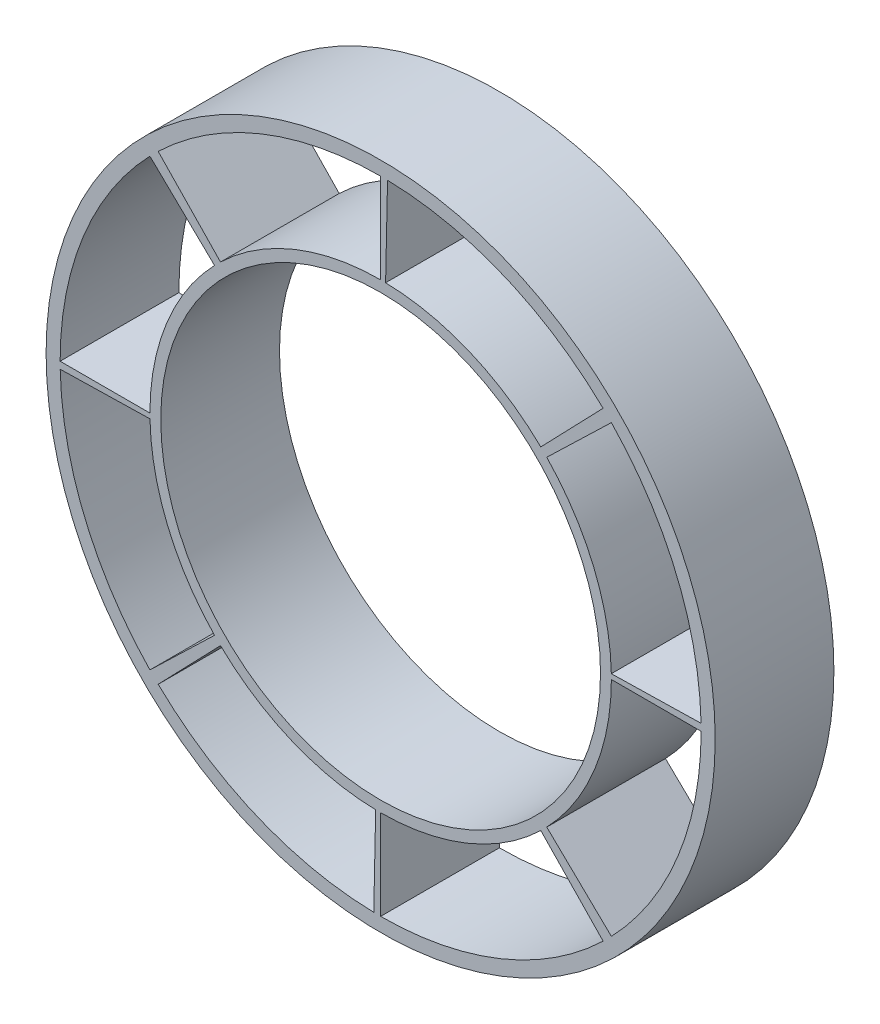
from build123d import *

# Parameters (mm, degrees)
ESQUISSE1_R        = 28.181352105
ESQUISSE1_R_2      = 18.520961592
BOSS_EXTRU_1_DEPTH = 10


with BuildPart() as part:
    # Esquisse1 → Boss.-Extru.1 (new body)
    with BuildSketch(Plane.XY):
        Circle(ESQUISSE1_R)
        with BuildLine():
            ThreePointArc((-13.490160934, -13.991873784), (-7.46697621, -17.944393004), (-0.417881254, -19.431478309))
            Line((-0.417881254, -19.431478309), (-0.580474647, -26.992071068))
            ThreePointArc((-0.580474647, -26.992071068), (-10.372301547, -24.926375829), (-18.739046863, -19.435971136))
            Line((-18.739046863, -19.435971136), (-13.490160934, -13.991873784))
        make_face(mode=Mode.SUBTRACT)
        with BuildLine():
            Line((-13.991873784, -13.490160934), (-19.435971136, -18.739046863))
            ThreePointArc((-19.435971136, -18.739046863), (-24.926075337, -10.373023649), (-26.99203739, -0.582038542))
            Line((-26.99203739, -0.582038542), (-19.431454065, -0.419007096))
            ThreePointArc((-19.431454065, -0.419007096), (-17.944176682, -7.467496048), (-13.991873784, -13.490160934))
        make_face(mode=Mode.SUBTRACT)
        with BuildLine():
            Line((0, -26.998312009), (0, -19.435971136))
            ThreePointArc((0, -19.435971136), (7.273627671, -18.023632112), (13.490160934, -13.991873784))
            Line((13.490160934, -13.991873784), (18.739046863, -19.435971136))
            ThreePointArc((18.739046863, -19.435971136), (10.103723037, -25.036446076), (0, -26.998312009))
        make_face(mode=Mode.SUBTRACT)
        with BuildLine():
            Line((19.435971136, -18.739046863), (13.991873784, -13.490160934))
            ThreePointArc((13.991873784, -13.490160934), (18.023632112, -7.273627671), (19.435971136, 0))
            Line((19.435971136, 0), (26.998312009, 0))
            ThreePointArc((26.998312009, 0), (25.036446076, -10.103723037), (19.435971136, -18.739046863))
        make_face(mode=Mode.SUBTRACT)
        with BuildLine():
            Line((-19.435971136, 18.739046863), (-13.991873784, 13.490160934))
            ThreePointArc((-13.991873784, 13.490160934), (-18.023632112, 7.273627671), (-19.435971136, 0))
            Line((-19.435971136, 0), (-26.998312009, 0))
            ThreePointArc((-26.998312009, 0), (-25.036446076, 10.103723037), (-19.435971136, 18.739046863))
        make_face(mode=Mode.SUBTRACT)
        with BuildLine():
            ThreePointArc((-18.739046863, 19.435971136), (-10.103723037, 25.036446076), (0, 26.998312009))
            Line((0, 26.998312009), (0, 19.435971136))
            ThreePointArc((0, 19.435971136), (-7.273627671, 18.023632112), (-13.490160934, 13.991873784))
            Line((-13.490160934, 13.991873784), (-18.739046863, 19.435971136))
        make_face(mode=Mode.SUBTRACT)
        Circle(ESQUISSE1_R_2, mode=Mode.SUBTRACT)
        with BuildLine():
            ThreePointArc((19.431454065, 0.419007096), (17.944176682, 7.467496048), (13.991873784, 13.490160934))
            Line((13.991873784, 13.490160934), (19.435971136, 18.739046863))
            ThreePointArc((19.435971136, 18.739046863), (24.926075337, 10.373023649), (26.99203739, 0.582038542))
            Line((26.99203739, 0.582038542), (19.431454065, 0.419007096))
        make_face(mode=Mode.SUBTRACT)
        with BuildLine():
            ThreePointArc((0.580474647, 26.992071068), (10.372301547, 24.926375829), (18.739046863, 19.435971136))
            Line((18.739046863, 19.435971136), (13.490160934, 13.991873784))
            ThreePointArc((13.490160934, 13.991873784), (7.46697621, 17.944393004), (0.417881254, 19.431478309))
            Line((0.417881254, 19.431478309), (0.580474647, 26.992071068))
        make_face(mode=Mode.SUBTRACT)
    extrude(amount=BOSS_EXTRU_1_DEPTH)


solid = part.part
